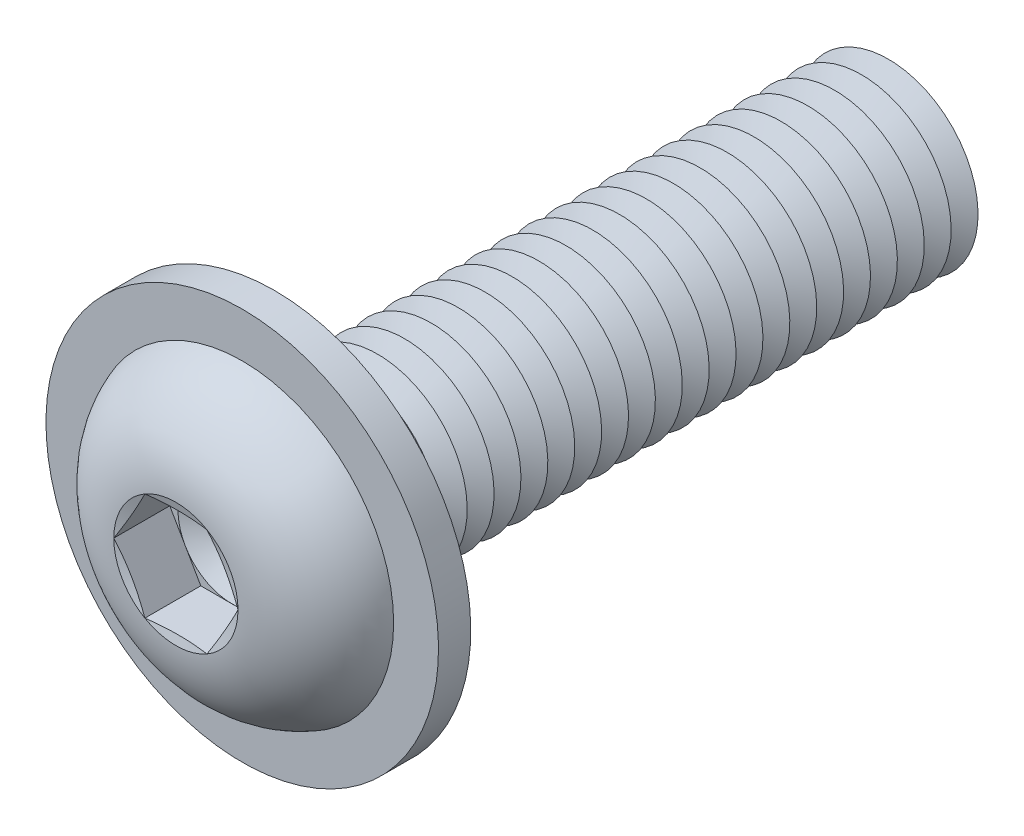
from build123d import *

# Parameters (mm, degrees)
FILLET1_R           = 0.75
LPATTERN1_COUNT     = 23
LPATTERN1_PITCH     = 1.5
CUT_EXTRUDE1_DEPTH  = 3.12
SKETCH5_R           = 10.95
SKETCH5_R_2         = 5.75
BOSS_EXTRUDE1_DEPTH = 1.8


with BuildPart() as part:
    # Sketch1 → Revolve1 (revolve)
    with BuildSketch(Plane(origin=(0, 0, 0), x_dir=(0, 0, -1), z_dir=(1, 0, 0))):
        with BuildLine():
            Line((0, 5), (0, 8.75))
            ThreePointArc((0, 8.75), (-3.814142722, 7.21429474), (-5.5, 3.4641))
            Line((-5.5, 3.4641), (-5.035898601, 1.73205))
            Line((-5.035898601, 1.73205), (-5.5, 1.73205))
            Line((-5.5, 1.73205), (-5.5, 0))
            Line((-5.5, 0), (35, 0))
            Line((35, 0), (35, 5))
            Line((35, 5), (0, 5))
        make_face()
    revolve(axis=Axis((0, 0, -35), (0, 0, 1)))

    # Fillet1
    fillet1_edges = [part.edges().sort_by_distance(p)[0] for p in [
        (0, -5, 0),
    ]]
    fillet(fillet1_edges, radius=FILLET1_R)

    # Sketch2 → Cut-Revolve1 (revolve, cut)
    with BuildSketch(Plane(origin=(0, 0, 0), x_dir=(0, 0, -1), z_dir=(1, 0, 0))):
        Polygon((34.25, 5), (35.75, 5), (35, 3.700961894), align=None)
    cut_revolve1 = revolve(axis=Axis((0, 0, -35), (0, 0, -1)), mode=Mode.SUBTRACT)

    # LPattern1: Cut-Revolve1 ×23
    with Locations(*[(0, 0, i * LPATTERN1_PITCH) for i in range(1, LPATTERN1_COUNT)]):
        add(cut_revolve1, mode=Mode.SUBTRACT)

    # Sketch3 → Cut-Extrude1 (cut)
    with BuildSketch(Plane.XY.offset(5.5)):
        Polygon((1.73205, 2.999998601), (-1.73205, 2.999998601), (-3.4641, 0), (-1.73205, -2.999998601), (1.73205, -2.999998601), (3.4641, 0), align=None)
    extrude(amount=-CUT_EXTRUDE1_DEPTH, mode=Mode.SUBTRACT)

    # Cut-Extrude2 cone 1 section (on through the dimple's axis) → Cut-Extrude2 (revolve, cut)
    with BuildSketch(Plane(origin=(0, 0, 2.38), x_dir=(0, -1, 0), z_dir=(1, 0, 0))):
        Polygon((0, 0), (2.999998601, 0), (0, 1.73205), align=None)
    revolve(axis=Axis((0, 0, 2.38), (0, 0, -1)), mode=Mode.SUBTRACT)

    # Sketch5 → Boss-Extrude1 (add)
    with BuildSketch(Plane(origin=(0, 0, 0), x_dir=(-1, 0, 0), z_dir=(0, 0, -1))):
        with Locations(Location((0, 0, 0), (0, 0, 90))):
            Circle(SKETCH5_R)
        Circle(SKETCH5_R_2, mode=Mode.SUBTRACT)
    extrude(amount=-BOSS_EXTRUDE1_DEPTH)


solid = part.part
